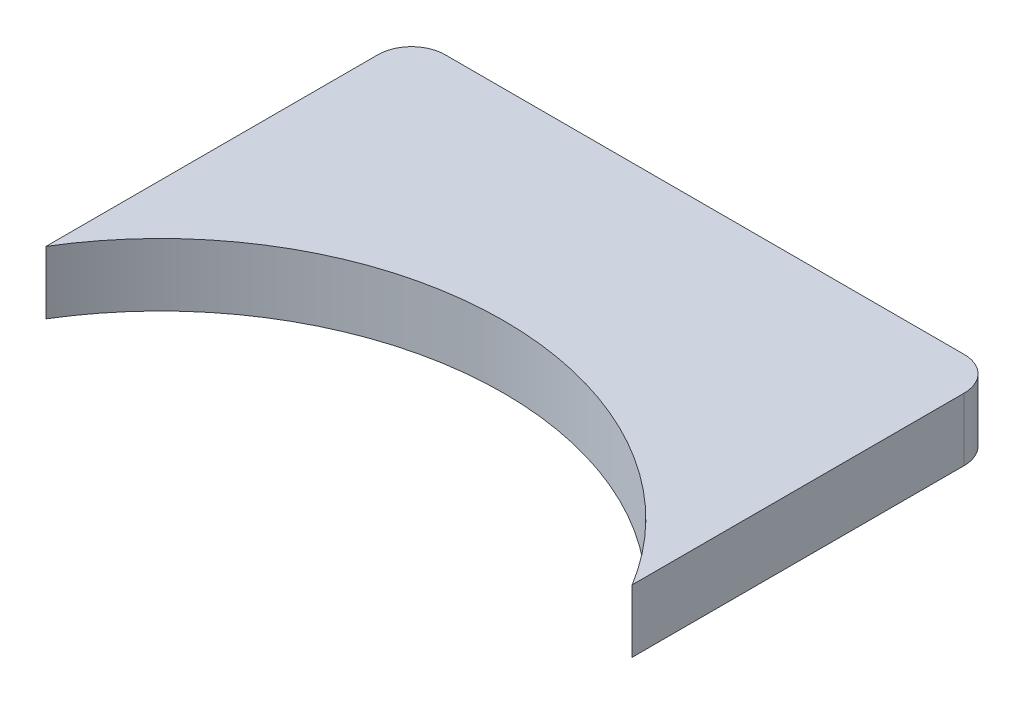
ISO-10303-21;
HEADER;
FILE_DESCRIPTION(('STEP AP214'),'2;1');
FILE_NAME('part.step','',(''),(''),'','','');
FILE_SCHEMA(('AUTOMOTIVE_DESIGN { 1 0 10303 214 1 1 1 1 }'));
ENDSEC;
DATA;
#1=APPLICATION_CONTEXT('core data for automotive mechanical design processes');
#2=APPLICATION_PROTOCOL_DEFINITION('international standard','automotive_design',2000,#1);
#3=PRODUCT_CONTEXT('',#1,'mechanical');
#4=PRODUCT('Part','Part','',(#3));
#5=PRODUCT_RELATED_PRODUCT_CATEGORY('part','',(#4));
#6=PRODUCT_DEFINITION_FORMATION('','',#4);
#7=PRODUCT_DEFINITION_CONTEXT('part definition',#1,'design');
#8=PRODUCT_DEFINITION('design','',#6,#7);
#9=PRODUCT_DEFINITION_SHAPE('','',#8);
#10=(LENGTH_UNIT() NAMED_UNIT(*) SI_UNIT(.MILLI.,.METRE.));
#11=(NAMED_UNIT(*) PLANE_ANGLE_UNIT() SI_UNIT($,.RADIAN.));
#12=(NAMED_UNIT(*) SI_UNIT($,.STERADIAN.) SOLID_ANGLE_UNIT());
#13=UNCERTAINTY_MEASURE_WITH_UNIT(LENGTH_MEASURE(1.E-05),#10,'distance_accuracy_value','');
#14=(GEOMETRIC_REPRESENTATION_CONTEXT(3) GLOBAL_UNCERTAINTY_ASSIGNED_CONTEXT((#13)) GLOBAL_UNIT_ASSIGNED_CONTEXT((#10,
#11,#12)) REPRESENTATION_CONTEXT('',''));
#15=CARTESIAN_POINT('',(0.,0.,0.));
#16=DIRECTION('',(0.,0.,1.));
#17=DIRECTION('',(1.,0.,0.));
#18=AXIS2_PLACEMENT_3D('',#15,#16,#17);
#19=CARTESIAN_POINT('',(39.37,9.525,-39.37));
#20=DIRECTION('',(0.,-1.,0.));
#21=DIRECTION('',(0.,0.,-1.));
#22=AXIS2_PLACEMENT_3D('',#19,#20,#21);
#23=CYLINDRICAL_SURFACE('',#22,5.08);
#24=CARTESIAN_POINT('',(39.37,0.,-39.37));
#25=DIRECTION('',(0.,1.,0.));
#26=DIRECTION('',(0.,0.,1.));
#27=AXIS2_PLACEMENT_3D('',#24,#25,#26);
#28=CIRCLE('',#27,5.08);
#29=CARTESIAN_POINT('',(44.45,0.,-39.37));
#30=VERTEX_POINT('',#29);
#31=CARTESIAN_POINT('',(39.37,0.,-44.45));
#32=VERTEX_POINT('',#31);
#33=EDGE_CURVE('E116',#30,#32,#28,.T.);
#34=ORIENTED_EDGE('',*,*,#33,.T.);
#35=DIRECTION('',(0.,-1.,0.));
#36=VECTOR('',#35,1.);
#37=CARTESIAN_POINT('',(39.37,9.525,-44.45));
#38=LINE('',#37,#36);
#39=CARTESIAN_POINT('',(39.37,9.525,-44.45));
#40=VERTEX_POINT('',#39);
#41=EDGE_CURVE('E11',#40,#32,#38,.T.);
#42=ORIENTED_EDGE('',*,*,#41,.F.);
#43=CARTESIAN_POINT('',(39.37,9.525,-39.37));
#44=DIRECTION('',(0.,1.,0.));
#45=DIRECTION('',(0.,0.,1.));
#46=AXIS2_PLACEMENT_3D('',#43,#44,#45);
#47=CIRCLE('',#46,5.08);
#48=CARTESIAN_POINT('',(44.45,9.525,-39.37));
#49=VERTEX_POINT('',#48);
#50=EDGE_CURVE('E126',#49,#40,#47,.T.);
#51=ORIENTED_EDGE('',*,*,#50,.F.);
#52=DIRECTION('',(0.,-1.,0.));
#53=VECTOR('',#52,1.);
#54=CARTESIAN_POINT('',(44.45,9.525,-39.37));
#55=LINE('',#54,#53);
#56=EDGE_CURVE('E112',#49,#30,#55,.T.);
#57=ORIENTED_EDGE('',*,*,#56,.T.);
#58=EDGE_LOOP('',(#34,#42,#51,#57));
#59=FACE_BOUND('',#58,.T.);
#60=ADVANCED_FACE('F32',(#59),#23,.T.);
#61=CARTESIAN_POINT('',(39.37,9.525,-44.45));
#62=DIRECTION('',(0.,0.,1.));
#63=DIRECTION('',(1.,0.,0.));
#64=AXIS2_PLACEMENT_3D('',#61,#62,#63);
#65=PLANE('',#64);
#66=DIRECTION('',(-1.,0.,0.));
#67=VECTOR('',#66,1.);
#68=CARTESIAN_POINT('',(39.37,0.,-44.45));
#69=LINE('',#68,#67);
#70=CARTESIAN_POINT('',(-39.37,0.,-44.45));
#71=VERTEX_POINT('',#70);
#72=EDGE_CURVE('E119',#32,#71,#69,.T.);
#73=ORIENTED_EDGE('',*,*,#72,.T.);
#74=DIRECTION('',(0.,-1.,0.));
#75=VECTOR('',#74,1.);
#76=CARTESIAN_POINT('',(-39.37,9.525,-44.45));
#77=LINE('',#76,#75);
#78=CARTESIAN_POINT('',(-39.37,9.525,-44.45));
#79=VERTEX_POINT('',#78);
#80=EDGE_CURVE('E40',#79,#71,#77,.T.);
#81=ORIENTED_EDGE('',*,*,#80,.F.);
#82=DIRECTION('',(-1.,0.,0.));
#83=VECTOR('',#82,1.);
#84=CARTESIAN_POINT('',(39.37,9.525,-44.45));
#85=LINE('',#84,#83);
#86=EDGE_CURVE('E85',#40,#79,#85,.T.);
#87=ORIENTED_EDGE('',*,*,#86,.F.);
#88=ORIENTED_EDGE('',*,*,#41,.T.);
#89=EDGE_LOOP('',(#73,#81,#87,#88));
#90=FACE_BOUND('',#89,.T.);
#91=ADVANCED_FACE('F150',(#90),#65,.F.);
#92=CARTESIAN_POINT('',(-39.37,9.525,-39.37));
#93=DIRECTION('',(0.,-1.,0.));
#94=DIRECTION('',(0.,0.,-1.));
#95=AXIS2_PLACEMENT_3D('',#92,#93,#94);
#96=CYLINDRICAL_SURFACE('',#95,5.08);
#97=CARTESIAN_POINT('',(-39.37,0.,-39.37));
#98=DIRECTION('',(0.,1.,0.));
#99=DIRECTION('',(0.,0.,1.));
#100=AXIS2_PLACEMENT_3D('',#97,#98,#99);
#101=CIRCLE('',#100,5.08);
#102=CARTESIAN_POINT('',(-44.45,0.,-39.3699999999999));
#103=VERTEX_POINT('',#102);
#104=EDGE_CURVE('E121',#71,#103,#101,.T.);
#105=ORIENTED_EDGE('',*,*,#104,.T.);
#106=DIRECTION('',(0.,-1.,0.));
#107=VECTOR('',#106,1.);
#108=CARTESIAN_POINT('',(-44.45,9.525,-39.3699999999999));
#109=LINE('',#108,#107);
#110=CARTESIAN_POINT('',(-44.45,9.525,-39.3699999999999));
#111=VERTEX_POINT('',#110);
#112=EDGE_CURVE('E107',#111,#103,#109,.T.);
#113=ORIENTED_EDGE('',*,*,#112,.F.);
#114=CARTESIAN_POINT('',(-39.37,9.525,-39.37));
#115=DIRECTION('',(0.,1.,0.));
#116=DIRECTION('',(0.,0.,1.));
#117=AXIS2_PLACEMENT_3D('',#114,#115,#116);
#118=CIRCLE('',#117,5.08);
#119=EDGE_CURVE('E98',#79,#111,#118,.T.);
#120=ORIENTED_EDGE('',*,*,#119,.F.);
#121=ORIENTED_EDGE('',*,*,#80,.T.);
#122=EDGE_LOOP('',(#105,#113,#120,#121));
#123=FACE_BOUND('',#122,.T.);
#124=ADVANCED_FACE('F132',(#123),#96,.T.);
#125=CARTESIAN_POINT('',(-44.45,9.525,10.9802212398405));
#126=DIRECTION('',(1.,0.,0.));
#127=DIRECTION('',(0.,0.,-1.));
#128=AXIS2_PLACEMENT_3D('',#125,#126,#127);
#129=PLANE('',#128);
#130=DIRECTION('',(0.,0.,1.));
#131=VECTOR('',#130,1.);
#132=CARTESIAN_POINT('',(-44.45,0.,10.9802212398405));
#133=LINE('',#132,#131);
#134=CARTESIAN_POINT('',(-44.45,0.,10.9802212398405));
#135=VERTEX_POINT('',#134);
#136=EDGE_CURVE('E106',#103,#135,#133,.T.);
#137=ORIENTED_EDGE('',*,*,#136,.T.);
#138=DIRECTION('',(0.,-1.,0.));
#139=VECTOR('',#138,1.);
#140=CARTESIAN_POINT('',(-44.45,9.525,10.9802212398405));
#141=LINE('',#140,#139);
#142=CARTESIAN_POINT('',(-44.45,9.525,10.9802212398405));
#143=VERTEX_POINT('',#142);
#144=EDGE_CURVE('E103',#143,#135,#141,.T.);
#145=ORIENTED_EDGE('',*,*,#144,.F.);
#146=DIRECTION('',(0.,0.,1.));
#147=VECTOR('',#146,1.);
#148=CARTESIAN_POINT('',(-44.45,9.525,10.9802212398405));
#149=LINE('',#148,#147);
#150=EDGE_CURVE('E92',#111,#143,#149,.T.);
#151=ORIENTED_EDGE('',*,*,#150,.F.);
#152=ORIENTED_EDGE('',*,*,#112,.T.);
#153=EDGE_LOOP('',(#137,#145,#151,#152));
#154=FACE_BOUND('',#153,.T.);
#155=ADVANCED_FACE('F104',(#154),#129,.F.);
#156=CARTESIAN_POINT('',(0.,9.525,38.1));
#157=DIRECTION('',(0.,-1.,0.));
#158=DIRECTION('',(0.,0.,-1.));
#159=AXIS2_PLACEMENT_3D('',#156,#157,#158);
#160=CYLINDRICAL_SURFACE('',#159,52.07);
#161=CARTESIAN_POINT('',(0.,0.,38.1));
#162=DIRECTION('',(0.,-1.,0.));
#163=DIRECTION('',(0.,0.,-1.));
#164=AXIS2_PLACEMENT_3D('',#161,#162,#163);
#165=CIRCLE('',#164,52.07);
#166=CARTESIAN_POINT('',(44.45,0.,10.9802212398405));
#167=VERTEX_POINT('',#166);
#168=EDGE_CURVE('E71',#135,#167,#165,.T.);
#169=ORIENTED_EDGE('',*,*,#168,.T.);
#170=DIRECTION('',(0.,-1.,0.));
#171=VECTOR('',#170,1.);
#172=CARTESIAN_POINT('',(44.45,9.525,10.9802212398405));
#173=LINE('',#172,#171);
#174=CARTESIAN_POINT('',(44.45,9.525,10.9802212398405));
#175=VERTEX_POINT('',#174);
#176=EDGE_CURVE('E108',#175,#167,#173,.T.);
#177=ORIENTED_EDGE('',*,*,#176,.F.);
#178=CARTESIAN_POINT('',(0.,9.525,38.1));
#179=DIRECTION('',(0.,-1.,0.));
#180=DIRECTION('',(0.,0.,-1.));
#181=AXIS2_PLACEMENT_3D('',#178,#179,#180);
#182=CIRCLE('',#181,52.07);
#183=EDGE_CURVE('E96',#143,#175,#182,.T.);
#184=ORIENTED_EDGE('',*,*,#183,.F.);
#185=ORIENTED_EDGE('',*,*,#144,.T.);
#186=EDGE_LOOP('',(#169,#177,#184,#185));
#187=FACE_BOUND('',#186,.T.);
#188=ADVANCED_FACE('F110',(#187),#160,.F.);
#189=CARTESIAN_POINT('',(44.45,9.525,10.9802212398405));
#190=DIRECTION('',(-1.,0.,0.));
#191=DIRECTION('',(0.,0.,1.));
#192=AXIS2_PLACEMENT_3D('',#189,#190,#191);
#193=PLANE('',#192);
#194=DIRECTION('',(0.,0.,-1.));
#195=VECTOR('',#194,1.);
#196=CARTESIAN_POINT('',(44.45,0.,10.9802212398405));
#197=LINE('',#196,#195);
#198=EDGE_CURVE('E77',#167,#30,#197,.T.);
#199=ORIENTED_EDGE('',*,*,#198,.T.);
#200=ORIENTED_EDGE('',*,*,#56,.F.);
#201=DIRECTION('',(0.,0.,-1.));
#202=VECTOR('',#201,1.);
#203=CARTESIAN_POINT('',(44.45,9.525,10.9802212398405));
#204=LINE('',#203,#202);
#205=EDGE_CURVE('E48',#175,#49,#204,.T.);
#206=ORIENTED_EDGE('',*,*,#205,.F.);
#207=ORIENTED_EDGE('',*,*,#176,.T.);
#208=EDGE_LOOP('',(#199,#200,#206,#207));
#209=FACE_BOUND('',#208,.T.);
#210=ADVANCED_FACE('F139',(#209),#193,.F.);
#211=CARTESIAN_POINT('',(39.37,9.525,-39.37));
#212=DIRECTION('',(0.,1.,0.));
#213=DIRECTION('',(0.,0.,1.));
#214=AXIS2_PLACEMENT_3D('',#211,#212,#213);
#215=PLANE('',#214);
#216=ORIENTED_EDGE('',*,*,#50,.T.);
#217=ORIENTED_EDGE('',*,*,#86,.T.);
#218=ORIENTED_EDGE('',*,*,#119,.T.);
#219=ORIENTED_EDGE('',*,*,#150,.T.);
#220=ORIENTED_EDGE('',*,*,#183,.T.);
#221=ORIENTED_EDGE('',*,*,#205,.T.);
#222=EDGE_LOOP('',(#216,#217,#218,#219,#220,#221));
#223=FACE_BOUND('',#222,.T.);
#224=ADVANCED_FACE('F94',(#223),#215,.T.);
#225=CARTESIAN_POINT('',(39.37,0.,-39.37));
#226=DIRECTION('',(0.,1.,0.));
#227=DIRECTION('',(0.,0.,1.));
#228=AXIS2_PLACEMENT_3D('',#225,#226,#227);
#229=PLANE('',#228);
#230=ORIENTED_EDGE('',*,*,#33,.F.);
#231=ORIENTED_EDGE('',*,*,#198,.F.);
#232=ORIENTED_EDGE('',*,*,#168,.F.);
#233=ORIENTED_EDGE('',*,*,#136,.F.);
#234=ORIENTED_EDGE('',*,*,#104,.F.);
#235=ORIENTED_EDGE('',*,*,#72,.F.);
#236=EDGE_LOOP('',(#230,#231,#232,#233,#234,#235));
#237=FACE_BOUND('',#236,.T.);
#238=ADVANCED_FACE('F135',(#237),#229,.F.);
#239=CLOSED_SHELL('',(#60,#91,#124,#155,#188,#210,#224,#238));
#240=MANIFOLD_SOLID_BREP('B2',#239);
#241=ADVANCED_BREP_SHAPE_REPRESENTATION('',(#18,#240),#14);
#242=SHAPE_DEFINITION_REPRESENTATION(#9,#241);
ENDSEC;
END-ISO-10303-21;
